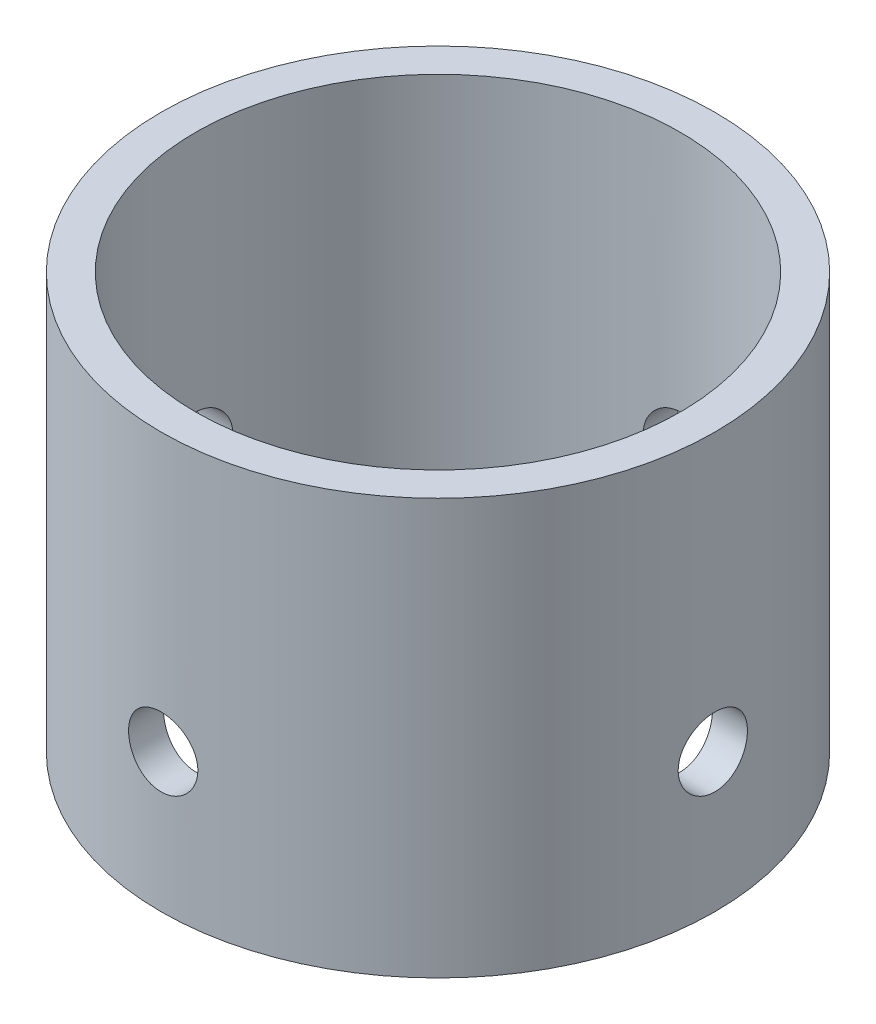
from build123d import *

# Parameters (mm, degrees)
SKETCH1_R           = 12.7
SKETCH1_R_2         = 11.1125
BOSS_EXTRUDE1_DEPTH = 19.05
SKETCH2_R           = 1.5875
CUT_EXTRUDE1_DEPTH  = 35.195796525
CIRPATTERN1_COUNT   = 2
CIRPATTERN1_ANGLE   = 90


with BuildPart() as part:
    # Sketch1 → Boss-Extrude1 (new body)
    with BuildSketch(Plane(origin=(0, 0, 0), x_dir=(1, 0, 0), z_dir=(0, 1, 0))):
        with Locations(Location((0, 0, 0), (0, 0, 90))):
            Circle(SKETCH1_R)
        with Locations(Location((0, 0, 0), (0, 0, 90))):
            Circle(SKETCH1_R_2, mode=Mode.SUBTRACT)
    extrude(amount=BOSS_EXTRUDE1_DEPTH)

    # Sketch2 → Cut-Extrude1 (cut, through all)
    with BuildSketch(Plane(origin=(0, 0, -12.7), x_dir=(-1, 0, 0), z_dir=(0, 0, -1))):
        with Locations(Location((0, 6.35, 0), (0, 0, 90.00000002))):
            Circle(SKETCH2_R)
    cut_extrude1 = extrude(amount=-CUT_EXTRUDE1_DEPTH, mode=Mode.SUBTRACT)

    # CirPattern1: Cut-Extrude1 ×2 about axis
    cirpattern1_axis = Axis((0, 19.05, 0), (0, -1, 0))
    for i in range(1, CIRPATTERN1_COUNT):
        add(cut_extrude1.rotate(cirpattern1_axis, i * CIRPATTERN1_ANGLE / (CIRPATTERN1_COUNT - 1)), mode=Mode.SUBTRACT)


solid = part.part
